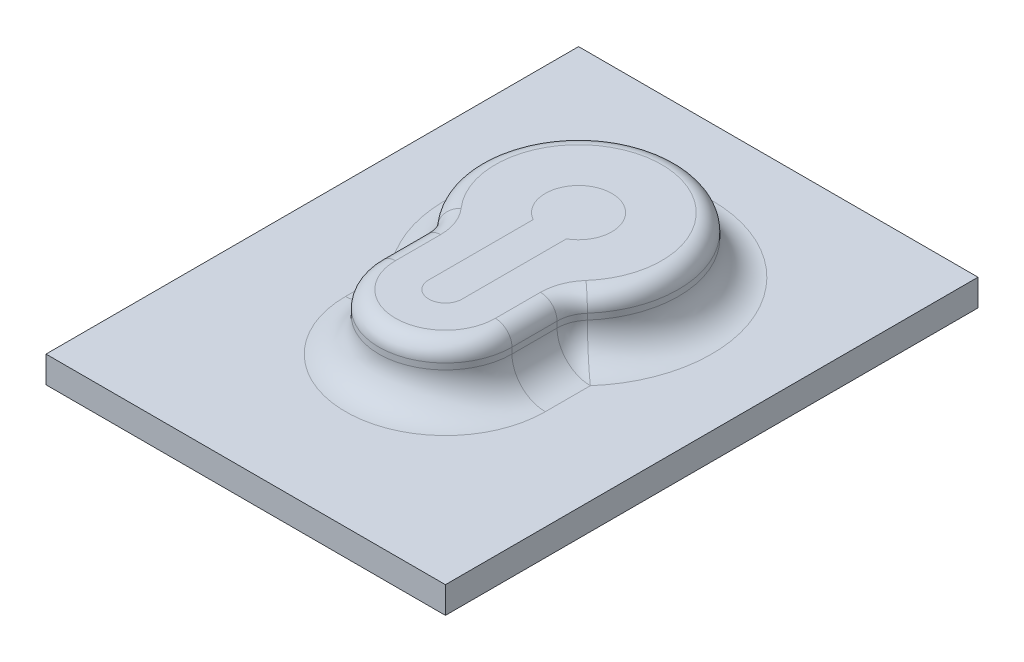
ISO-10303-21;
HEADER;
FILE_DESCRIPTION(('STEP AP214'),'2;1');
FILE_NAME('part.step','',(''),(''),'','','');
FILE_SCHEMA(('AUTOMOTIVE_DESIGN { 1 0 10303 214 1 1 1 1 }'));
ENDSEC;
DATA;
#1=APPLICATION_CONTEXT('core data for automotive mechanical design processes');
#2=APPLICATION_PROTOCOL_DEFINITION('international standard','automotive_design',2000,#1);
#3=PRODUCT_CONTEXT('',#1,'mechanical');
#4=PRODUCT('Part','Part','',(#3));
#5=PRODUCT_RELATED_PRODUCT_CATEGORY('part','',(#4));
#6=PRODUCT_DEFINITION_FORMATION('','',#4);
#7=PRODUCT_DEFINITION_CONTEXT('part definition',#1,'design');
#8=PRODUCT_DEFINITION('design','',#6,#7);
#9=PRODUCT_DEFINITION_SHAPE('','',#8);
#10=(LENGTH_UNIT() NAMED_UNIT(*) SI_UNIT(.MILLI.,.METRE.));
#11=(NAMED_UNIT(*) PLANE_ANGLE_UNIT() SI_UNIT($,.RADIAN.));
#12=(NAMED_UNIT(*) SI_UNIT($,.STERADIAN.) SOLID_ANGLE_UNIT());
#13=UNCERTAINTY_MEASURE_WITH_UNIT(LENGTH_MEASURE(1.E-05),#10,'distance_accuracy_value','');
#14=(GEOMETRIC_REPRESENTATION_CONTEXT(3) GLOBAL_UNCERTAINTY_ASSIGNED_CONTEXT((#13)) GLOBAL_UNIT_ASSIGNED_CONTEXT((#10,
#11,#12)) REPRESENTATION_CONTEXT('',''));
#15=CARTESIAN_POINT('',(0.,0.,0.));
#16=DIRECTION('',(0.,0.,1.));
#17=DIRECTION('',(1.,0.,0.));
#18=AXIS2_PLACEMENT_3D('',#15,#16,#17);
#19=CARTESIAN_POINT('',(9.525,7.874,8.40026041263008));
#20=DIRECTION('',(0.,-1.,0.));
#21=DIRECTION('',(0.,0.,-1.));
#22=AXIS2_PLACEMENT_3D('',#19,#20,#21);
#23=PLANE('',#22);
#24=CARTESIAN_POINT('',(-9.525,7.874,8.40026041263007));
#25=DIRECTION('',(0.,-1.,0.));
#26=DIRECTION('',(0.,0.,-1.));
#27=AXIS2_PLACEMENT_3D('',#24,#25,#26);
#28=CIRCLE('',#27,4.7625);
#29=CARTESIAN_POINT('',(-5.953125,7.874,5.25016275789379));
#30=VERTEX_POINT('',#29);
#31=CARTESIAN_POINT('',(-4.7625,7.874,8.40026041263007));
#32=VERTEX_POINT('',#31);
#33=EDGE_CURVE('E236',#30,#32,#28,.T.);
#34=ORIENTED_EDGE('',*,*,#33,.T.);
#35=DIRECTION('',(0.,0.,1.));
#36=VECTOR('',#35,1.);
#37=CARTESIAN_POINT('',(-4.7625,7.874,8.40026041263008));
#38=LINE('',#37,#36);
#39=CARTESIAN_POINT('',(-4.7625,7.874,12.7));
#40=VERTEX_POINT('',#39);
#41=EDGE_CURVE('E238',#32,#40,#38,.T.);
#42=ORIENTED_EDGE('',*,*,#41,.T.);
#43=CARTESIAN_POINT('',(0.,7.874,12.7));
#44=DIRECTION('',(0.,-1.,0.));
#45=DIRECTION('',(0.,0.,-1.));
#46=AXIS2_PLACEMENT_3D('',#43,#44,#45);
#47=CIRCLE('',#46,4.7625);
#48=CARTESIAN_POINT('',(4.7625,7.874,12.7));
#49=VERTEX_POINT('',#48);
#50=EDGE_CURVE('E209',#40,#49,#47,.F.);
#51=ORIENTED_EDGE('',*,*,#50,.T.);
#52=DIRECTION('',(0.,0.,-1.));
#53=VECTOR('',#52,1.);
#54=CARTESIAN_POINT('',(4.7625,7.874,8.40026041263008));
#55=LINE('',#54,#53);
#56=CARTESIAN_POINT('',(4.7625,7.874,8.40026041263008));
#57=VERTEX_POINT('',#56);
#58=EDGE_CURVE('E230',#49,#57,#55,.T.);
#59=ORIENTED_EDGE('',*,*,#58,.T.);
#60=CARTESIAN_POINT('',(9.525,7.874,8.40026041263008));
#61=DIRECTION('',(0.,-1.,0.));
#62=DIRECTION('',(0.,0.,-1.));
#63=AXIS2_PLACEMENT_3D('',#60,#61,#62);
#64=CIRCLE('',#63,4.7625);
#65=CARTESIAN_POINT('',(5.953125,7.874,5.2501627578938));
#66=VERTEX_POINT('',#65);
#67=EDGE_CURVE('E232',#57,#66,#64,.T.);
#68=ORIENTED_EDGE('',*,*,#67,.T.);
#69=CARTESIAN_POINT('',(0.,7.874,0.));
#70=DIRECTION('',(0.,-1.,0.));
#71=DIRECTION('',(0.,0.,-1.));
#72=AXIS2_PLACEMENT_3D('',#69,#70,#71);
#73=CIRCLE('',#72,7.9375);
#74=EDGE_CURVE('E234',#66,#30,#73,.F.);
#75=ORIENTED_EDGE('',*,*,#74,.T.);
#76=EDGE_LOOP('',(#34,#42,#51,#59,#68,#75));
#77=FACE_BOUND('',#76,.T.);
#78=CARTESIAN_POINT('',(0.,7.874,12.7));
#79=DIRECTION('',(0.,-1.,0.));
#80=DIRECTION('',(0.,0.,-1.));
#81=AXIS2_PLACEMENT_3D('',#78,#79,#80);
#82=CIRCLE('',#81,1.5875);
#83=CARTESIAN_POINT('',(-1.5875,7.874,12.7));
#84=VERTEX_POINT('',#83);
#85=CARTESIAN_POINT('',(1.5875,7.874,12.7));
#86=VERTEX_POINT('',#85);
#87=EDGE_CURVE('E12',#84,#86,#82,.F.);
#88=ORIENTED_EDGE('',*,*,#87,.F.);
#89=DIRECTION('',(0.,0.,1.));
#90=VECTOR('',#89,1.);
#91=CARTESIAN_POINT('',(-1.5875,7.874,8.40026041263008));
#92=LINE('',#91,#90);
#93=CARTESIAN_POINT('',(-1.5875,7.874,2.74963065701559));
#94=VERTEX_POINT('',#93);
#95=EDGE_CURVE('E254',#94,#84,#92,.T.);
#96=ORIENTED_EDGE('',*,*,#95,.F.);
#97=CARTESIAN_POINT('',(0.,7.874,0.));
#98=DIRECTION('',(0.,-1.,0.));
#99=DIRECTION('',(0.,0.,-1.));
#100=AXIS2_PLACEMENT_3D('',#97,#98,#99);
#101=CIRCLE('',#100,3.175);
#102=CARTESIAN_POINT('',(1.5875,7.874,2.74963065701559));
#103=VERTEX_POINT('',#102);
#104=EDGE_CURVE('E272',#103,#94,#101,.F.);
#105=ORIENTED_EDGE('',*,*,#104,.F.);
#106=DIRECTION('',(0.,0.,-1.));
#107=VECTOR('',#106,1.);
#108=CARTESIAN_POINT('',(1.5875,7.874,8.40026041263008));
#109=LINE('',#108,#107);
#110=EDGE_CURVE('E46',#86,#103,#109,.T.);
#111=ORIENTED_EDGE('',*,*,#110,.F.);
#112=EDGE_LOOP('',(#88,#96,#105,#111));
#113=FACE_BOUND('',#112,.T.);
#114=ADVANCED_FACE('F37',(#77,#113),#23,.F.);
#115=CARTESIAN_POINT('',(-19.05,2.54,-19.05));
#116=DIRECTION('',(1.,0.,0.));
#117=DIRECTION('',(0.,0.,-1.));
#118=AXIS2_PLACEMENT_3D('',#115,#116,#117);
#119=PLANE('',#118);
#120=DIRECTION('',(0.,0.,1.));
#121=VECTOR('',#120,1.);
#122=CARTESIAN_POINT('',(-19.05,0.,-19.05));
#123=LINE('',#122,#121);
#124=CARTESIAN_POINT('',(-19.05,0.,-19.05));
#125=VERTEX_POINT('',#124);
#126=CARTESIAN_POINT('',(-19.05,0.,31.75));
#127=VERTEX_POINT('',#126);
#128=EDGE_CURVE('E176',#125,#127,#123,.T.);
#129=ORIENTED_EDGE('',*,*,#128,.T.);
#130=DIRECTION('',(0.,-1.,0.));
#131=VECTOR('',#130,1.);
#132=CARTESIAN_POINT('',(-19.05,2.54,31.75));
#133=LINE('',#132,#131);
#134=CARTESIAN_POINT('',(-19.05,2.54,31.75));
#135=VERTEX_POINT('',#134);
#136=EDGE_CURVE('E156',#135,#127,#133,.T.);
#137=ORIENTED_EDGE('',*,*,#136,.F.);
#138=DIRECTION('',(0.,0.,1.));
#139=VECTOR('',#138,1.);
#140=CARTESIAN_POINT('',(-19.05,2.54,-19.05));
#141=LINE('',#140,#139);
#142=CARTESIAN_POINT('',(-19.05,2.54,-19.05));
#143=VERTEX_POINT('',#142);
#144=EDGE_CURVE('E163',#143,#135,#141,.T.);
#145=ORIENTED_EDGE('',*,*,#144,.F.);
#146=DIRECTION('',(0.,-1.,0.));
#147=VECTOR('',#146,1.);
#148=CARTESIAN_POINT('',(-19.05,2.54,-19.05));
#149=LINE('',#148,#147);
#150=EDGE_CURVE('E413',#143,#125,#149,.T.);
#151=ORIENTED_EDGE('',*,*,#150,.T.);
#152=EDGE_LOOP('',(#129,#137,#145,#151));
#153=FACE_BOUND('',#152,.T.);
#154=ADVANCED_FACE('F174',(#153),#119,.F.);
#155=CARTESIAN_POINT('',(19.05,2.54,31.75));
#156=DIRECTION('',(0.,0.,-1.));
#157=DIRECTION('',(-1.,0.,0.));
#158=AXIS2_PLACEMENT_3D('',#155,#156,#157);
#159=PLANE('',#158);
#160=DIRECTION('',(1.,0.,0.));
#161=VECTOR('',#160,1.);
#162=CARTESIAN_POINT('',(19.05,0.,31.75));
#163=LINE('',#162,#161);
#164=CARTESIAN_POINT('',(19.05,0.,31.75));
#165=VERTEX_POINT('',#164);
#166=EDGE_CURVE('E415',#127,#165,#163,.T.);
#167=ORIENTED_EDGE('',*,*,#166,.T.);
#168=DIRECTION('',(0.,-1.,0.));
#169=VECTOR('',#168,1.);
#170=CARTESIAN_POINT('',(19.05,2.54,31.75));
#171=LINE('',#170,#169);
#172=CARTESIAN_POINT('',(19.05,2.54,31.75));
#173=VERTEX_POINT('',#172);
#174=EDGE_CURVE('E159',#173,#165,#171,.T.);
#175=ORIENTED_EDGE('',*,*,#174,.F.);
#176=DIRECTION('',(1.,0.,0.));
#177=VECTOR('',#176,1.);
#178=CARTESIAN_POINT('',(19.05,2.54,31.75));
#179=LINE('',#178,#177);
#180=EDGE_CURVE('E152',#135,#173,#179,.T.);
#181=ORIENTED_EDGE('',*,*,#180,.F.);
#182=ORIENTED_EDGE('',*,*,#136,.T.);
#183=EDGE_LOOP('',(#167,#175,#181,#182));
#184=FACE_BOUND('',#183,.T.);
#185=ADVANCED_FACE('F154',(#184),#159,.F.);
#186=CARTESIAN_POINT('',(19.05,2.54,-19.05));
#187=DIRECTION('',(-1.,0.,0.));
#188=DIRECTION('',(0.,0.,1.));
#189=AXIS2_PLACEMENT_3D('',#186,#187,#188);
#190=PLANE('',#189);
#191=DIRECTION('',(0.,0.,-1.));
#192=VECTOR('',#191,1.);
#193=CARTESIAN_POINT('',(19.05,0.,-19.05));
#194=LINE('',#193,#192);
#195=CARTESIAN_POINT('',(19.05,0.,-19.05));
#196=VERTEX_POINT('',#195);
#197=EDGE_CURVE('E417',#165,#196,#194,.T.);
#198=ORIENTED_EDGE('',*,*,#197,.T.);
#199=DIRECTION('',(0.,-1.,0.));
#200=VECTOR('',#199,1.);
#201=CARTESIAN_POINT('',(19.05,2.54,-19.05));
#202=LINE('',#201,#200);
#203=CARTESIAN_POINT('',(19.05,2.54,-19.05));
#204=VERTEX_POINT('',#203);
#205=EDGE_CURVE('E182',#204,#196,#202,.T.);
#206=ORIENTED_EDGE('',*,*,#205,.F.);
#207=DIRECTION('',(0.,0.,-1.));
#208=VECTOR('',#207,1.);
#209=CARTESIAN_POINT('',(19.05,2.54,-19.05));
#210=LINE('',#209,#208);
#211=EDGE_CURVE('E162',#173,#204,#210,.T.);
#212=ORIENTED_EDGE('',*,*,#211,.F.);
#213=ORIENTED_EDGE('',*,*,#174,.T.);
#214=EDGE_LOOP('',(#198,#206,#212,#213));
#215=FACE_BOUND('',#214,.T.);
#216=ADVANCED_FACE('F339',(#215),#190,.F.);
#217=CARTESIAN_POINT('',(19.05,2.54,-19.05));
#218=DIRECTION('',(0.,0.,1.));
#219=DIRECTION('',(1.,0.,0.));
#220=AXIS2_PLACEMENT_3D('',#217,#218,#219);
#221=PLANE('',#220);
#222=DIRECTION('',(-1.,0.,0.));
#223=VECTOR('',#222,1.);
#224=CARTESIAN_POINT('',(19.05,0.,-19.05));
#225=LINE('',#224,#223);
#226=EDGE_CURVE('E172',#196,#125,#225,.T.);
#227=ORIENTED_EDGE('',*,*,#226,.T.);
#228=ORIENTED_EDGE('',*,*,#150,.F.);
#229=DIRECTION('',(-1.,0.,0.));
#230=VECTOR('',#229,1.);
#231=CARTESIAN_POINT('',(19.05,2.54,-19.05));
#232=LINE('',#231,#230);
#233=EDGE_CURVE('E168',#204,#143,#232,.T.);
#234=ORIENTED_EDGE('',*,*,#233,.F.);
#235=ORIENTED_EDGE('',*,*,#205,.T.);
#236=EDGE_LOOP('',(#227,#228,#234,#235));
#237=FACE_BOUND('',#236,.T.);
#238=ADVANCED_FACE('F332',(#237),#221,.F.);
#239=CARTESIAN_POINT('',(0.,2.54,0.));
#240=DIRECTION('',(0.,-1.,0.));
#241=DIRECTION('',(0.,0.,-1.));
#242=AXIS2_PLACEMENT_3D('',#239,#240,#241);
#243=PLANE('',#242);
#244=CARTESIAN_POINT('',(0.,2.54,12.7));
#245=DIRECTION('',(0.,-1.,0.));
#246=DIRECTION('',(0.,0.,-1.));
#247=AXIS2_PLACEMENT_3D('',#244,#245,#246);
#248=CIRCLE('',#247,9.525);
#249=CARTESIAN_POINT('',(9.525,2.54,12.7));
#250=VERTEX_POINT('',#249);
#251=CARTESIAN_POINT('',(-9.525,2.54,12.7));
#252=VERTEX_POINT('',#251);
#253=EDGE_CURVE('E180',#250,#252,#248,.T.);
#254=ORIENTED_EDGE('',*,*,#253,.T.);
#255=DIRECTION('',(0.,0.,1.));
#256=VECTOR('',#255,1.);
#257=CARTESIAN_POINT('',(-9.525,2.54,8.40026041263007));
#258=LINE('',#257,#256);
#259=CARTESIAN_POINT('',(-9.525,2.54,8.40026041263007));
#260=VERTEX_POINT('',#259);
#261=EDGE_CURVE('E191',#252,#260,#258,.F.);
#262=ORIENTED_EDGE('',*,*,#261,.T.);
#263=CARTESIAN_POINT('',(0.,2.54,0.));
#264=DIRECTION('',(0.,-1.,0.));
#265=DIRECTION('',(0.,0.,-1.));
#266=AXIS2_PLACEMENT_3D('',#263,#264,#265);
#267=CIRCLE('',#266,12.7);
#268=CARTESIAN_POINT('',(9.525,2.54,8.40026041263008));
#269=VERTEX_POINT('',#268);
#270=EDGE_CURVE('E189',#260,#269,#267,.T.);
#271=ORIENTED_EDGE('',*,*,#270,.T.);
#272=DIRECTION('',(0.,0.,-1.));
#273=VECTOR('',#272,1.);
#274=CARTESIAN_POINT('',(9.525,2.54,12.7));
#275=LINE('',#274,#273);
#276=EDGE_CURVE('E187',#269,#250,#275,.F.);
#277=ORIENTED_EDGE('',*,*,#276,.T.);
#278=EDGE_LOOP('',(#254,#262,#271,#277));
#279=FACE_BOUND('',#278,.T.);
#280=ORIENTED_EDGE('',*,*,#144,.T.);
#281=ORIENTED_EDGE('',*,*,#180,.T.);
#282=ORIENTED_EDGE('',*,*,#211,.T.);
#283=ORIENTED_EDGE('',*,*,#233,.T.);
#284=EDGE_LOOP('',(#280,#281,#282,#283));
#285=FACE_BOUND('',#284,.T.);
#286=ADVANCED_FACE('F166',(#279,#285),#243,.F.);
#287=CARTESIAN_POINT('',(0.,0.,0.));
#288=DIRECTION('',(0.,-1.,0.));
#289=DIRECTION('',(0.,0.,-1.));
#290=AXIS2_PLACEMENT_3D('',#287,#288,#289);
#291=PLANE('',#290);
#292=ORIENTED_EDGE('',*,*,#128,.F.);
#293=ORIENTED_EDGE('',*,*,#226,.F.);
#294=ORIENTED_EDGE('',*,*,#197,.F.);
#295=ORIENTED_EDGE('',*,*,#166,.F.);
#296=EDGE_LOOP('',(#292,#293,#294,#295));
#297=FACE_BOUND('',#296,.T.);
#298=ADVANCED_FACE('F328',(#297),#291,.T.);
#299=CARTESIAN_POINT('',(9.525,7.874,8.40026041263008));
#300=DIRECTION('',(0.,-1.,0.));
#301=DIRECTION('',(0.,0.,-1.));
#302=AXIS2_PLACEMENT_3D('',#299,#300,#301);
#303=CYLINDRICAL_SURFACE('',#302,3.175);
#304=DIRECTION('',(0.,-1.,0.));
#305=VECTOR('',#304,1.);
#306=CARTESIAN_POINT('',(7.14375,7.874,6.30019530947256));
#307=LINE('',#306,#305);
#308=CARTESIAN_POINT('',(7.14375,6.2865,6.30019530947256));
#309=VERTEX_POINT('',#308);
#310=CARTESIAN_POINT('',(7.14375,5.715,6.30019530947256));
#311=VERTEX_POINT('',#310);
#312=EDGE_CURVE('E396',#309,#311,#307,.T.);
#313=ORIENTED_EDGE('',*,*,#312,.F.);
#314=CARTESIAN_POINT('',(9.525,6.2865,8.40026041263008));
#315=DIRECTION('',(0.,-1.,0.));
#316=DIRECTION('',(0.,0.,-1.));
#317=AXIS2_PLACEMENT_3D('',#314,#315,#316);
#318=CIRCLE('',#317,3.175);
#319=CARTESIAN_POINT('',(6.35,6.2865,8.40026041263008));
#320=VERTEX_POINT('',#319);
#321=EDGE_CURVE('E248',#309,#320,#318,.F.);
#322=ORIENTED_EDGE('',*,*,#321,.T.);
#323=DIRECTION('',(0.,-1.,0.));
#324=VECTOR('',#323,1.);
#325=CARTESIAN_POINT('',(6.35,7.874,8.40026041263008));
#326=LINE('',#325,#324);
#327=CARTESIAN_POINT('',(6.35,5.715,8.40026041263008));
#328=VERTEX_POINT('',#327);
#329=EDGE_CURVE('E228',#320,#328,#326,.T.);
#330=ORIENTED_EDGE('',*,*,#329,.T.);
#331=CARTESIAN_POINT('',(9.525,5.715,8.40026041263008));
#332=DIRECTION('',(0.,-1.,0.));
#333=DIRECTION('',(0.,0.,-1.));
#334=AXIS2_PLACEMENT_3D('',#331,#332,#333);
#335=CIRCLE('',#334,3.175);
#336=EDGE_CURVE('E200',#328,#311,#335,.T.);
#337=ORIENTED_EDGE('',*,*,#336,.T.);
#338=EDGE_LOOP('',(#313,#322,#330,#337));
#339=FACE_BOUND('',#338,.T.);
#340=ADVANCED_FACE('F324',(#339),#303,.F.);
#341=CARTESIAN_POINT('',(0.,7.874,0.));
#342=DIRECTION('',(0.,-1.,0.));
#343=DIRECTION('',(0.,0.,-1.));
#344=AXIS2_PLACEMENT_3D('',#341,#342,#343);
#345=CYLINDRICAL_SURFACE('',#344,9.525);
#346=DIRECTION('',(0.,-1.,0.));
#347=VECTOR('',#346,1.);
#348=CARTESIAN_POINT('',(-7.14375,7.874,6.30019530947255));
#349=LINE('',#348,#347);
#350=CARTESIAN_POINT('',(-7.14375,6.2865,6.30019530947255));
#351=VERTEX_POINT('',#350);
#352=CARTESIAN_POINT('',(-7.14375,5.715,6.30019530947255));
#353=VERTEX_POINT('',#352);
#354=EDGE_CURVE('E408',#351,#353,#349,.T.);
#355=ORIENTED_EDGE('',*,*,#354,.F.);
#356=CARTESIAN_POINT('',(0.,6.2865,0.));
#357=DIRECTION('',(0.,-1.,0.));
#358=DIRECTION('',(0.,0.,-1.));
#359=AXIS2_PLACEMENT_3D('',#356,#357,#358);
#360=CIRCLE('',#359,9.525);
#361=EDGE_CURVE('E246',#351,#309,#360,.T.);
#362=ORIENTED_EDGE('',*,*,#361,.T.);
#363=ORIENTED_EDGE('',*,*,#312,.T.);
#364=CARTESIAN_POINT('',(0.,5.715,0.));
#365=DIRECTION('',(0.,-1.,0.));
#366=DIRECTION('',(0.,0.,-1.));
#367=AXIS2_PLACEMENT_3D('',#364,#365,#366);
#368=CIRCLE('',#367,9.525);
#369=EDGE_CURVE('E197',#311,#353,#368,.F.);
#370=ORIENTED_EDGE('',*,*,#369,.T.);
#371=EDGE_LOOP('',(#355,#362,#363,#370));
#372=FACE_BOUND('',#371,.T.);
#373=ADVANCED_FACE('F320',(#372),#345,.T.);
#374=CARTESIAN_POINT('',(-9.525,7.874,8.40026041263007));
#375=DIRECTION('',(0.,-1.,0.));
#376=DIRECTION('',(0.,0.,-1.));
#377=AXIS2_PLACEMENT_3D('',#374,#375,#376);
#378=CYLINDRICAL_SURFACE('',#377,3.175);
#379=DIRECTION('',(0.,-1.,0.));
#380=VECTOR('',#379,1.);
#381=CARTESIAN_POINT('',(-6.35,7.874,8.40026041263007));
#382=LINE('',#381,#380);
#383=CARTESIAN_POINT('',(-6.35,6.2865,8.40026041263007));
#384=VERTEX_POINT('',#383);
#385=CARTESIAN_POINT('',(-6.35,5.715,8.40026041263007));
#386=VERTEX_POINT('',#385);
#387=EDGE_CURVE('E406',#384,#386,#382,.T.);
#388=ORIENTED_EDGE('',*,*,#387,.F.);
#389=CARTESIAN_POINT('',(-9.525,6.2865,8.40026041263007));
#390=DIRECTION('',(0.,-1.,0.));
#391=DIRECTION('',(0.,0.,-1.));
#392=AXIS2_PLACEMENT_3D('',#389,#390,#391);
#393=CIRCLE('',#392,3.175);
#394=EDGE_CURVE('E244',#384,#351,#393,.F.);
#395=ORIENTED_EDGE('',*,*,#394,.T.);
#396=ORIENTED_EDGE('',*,*,#354,.T.);
#397=CARTESIAN_POINT('',(-9.525,5.715,8.40026041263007));
#398=DIRECTION('',(0.,-1.,0.));
#399=DIRECTION('',(0.,0.,-1.));
#400=AXIS2_PLACEMENT_3D('',#397,#398,#399);
#401=CIRCLE('',#400,3.175);
#402=EDGE_CURVE('E194',#353,#386,#401,.T.);
#403=ORIENTED_EDGE('',*,*,#402,.T.);
#404=EDGE_LOOP('',(#388,#395,#396,#403));
#405=FACE_BOUND('',#404,.T.);
#406=ADVANCED_FACE('F316',(#405),#378,.F.);
#407=CARTESIAN_POINT('',(-6.35,7.874,8.40026041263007));
#408=DIRECTION('',(1.,0.,0.));
#409=DIRECTION('',(0.,0.,-1.));
#410=AXIS2_PLACEMENT_3D('',#407,#408,#409);
#411=PLANE('',#410);
#412=DIRECTION('',(0.,-1.,0.));
#413=VECTOR('',#412,1.);
#414=CARTESIAN_POINT('',(-6.35,7.874,12.7));
#415=LINE('',#414,#413);
#416=CARTESIAN_POINT('',(-6.35,6.2865,12.7));
#417=VERTEX_POINT('',#416);
#418=CARTESIAN_POINT('',(-6.35,5.715,12.7));
#419=VERTEX_POINT('',#418);
#420=EDGE_CURVE('E402',#417,#419,#415,.T.);
#421=ORIENTED_EDGE('',*,*,#420,.F.);
#422=DIRECTION('',(0.,0.,1.));
#423=VECTOR('',#422,1.);
#424=CARTESIAN_POINT('',(-6.35,6.2865,8.40026041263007));
#425=LINE('',#424,#423);
#426=EDGE_CURVE('E241',#417,#384,#425,.F.);
#427=ORIENTED_EDGE('',*,*,#426,.T.);
#428=ORIENTED_EDGE('',*,*,#387,.T.);
#429=DIRECTION('',(0.,0.,1.));
#430=VECTOR('',#429,1.);
#431=CARTESIAN_POINT('',(-6.35,5.715,12.7));
#432=LINE('',#431,#430);
#433=EDGE_CURVE('E177',#386,#419,#432,.T.);
#434=ORIENTED_EDGE('',*,*,#433,.T.);
#435=EDGE_LOOP('',(#421,#427,#428,#434));
#436=FACE_BOUND('',#435,.T.);
#437=ADVANCED_FACE('F309',(#436),#411,.F.);
#438=CARTESIAN_POINT('',(0.,7.874,12.7));
#439=DIRECTION('',(0.,-1.,0.));
#440=DIRECTION('',(0.,0.,-1.));
#441=AXIS2_PLACEMENT_3D('',#438,#439,#440);
#442=CYLINDRICAL_SURFACE('',#441,6.35);
#443=DIRECTION('',(0.,-1.,0.));
#444=VECTOR('',#443,1.);
#445=CARTESIAN_POINT('',(6.35,7.874,12.7));
#446=LINE('',#445,#444);
#447=CARTESIAN_POINT('',(6.35,6.2865,12.7));
#448=VERTEX_POINT('',#447);
#449=CARTESIAN_POINT('',(6.35,5.715,12.7));
#450=VERTEX_POINT('',#449);
#451=EDGE_CURVE('E400',#448,#450,#446,.T.);
#452=ORIENTED_EDGE('',*,*,#451,.F.);
#453=CARTESIAN_POINT('',(0.,6.2865,12.7));
#454=DIRECTION('',(0.,-1.,0.));
#455=DIRECTION('',(0.,0.,-1.));
#456=AXIS2_PLACEMENT_3D('',#453,#454,#455);
#457=CIRCLE('',#456,6.35);
#458=EDGE_CURVE('E252',#448,#417,#457,.T.);
#459=ORIENTED_EDGE('',*,*,#458,.T.);
#460=ORIENTED_EDGE('',*,*,#420,.T.);
#461=CARTESIAN_POINT('',(0.,5.715,12.7));
#462=DIRECTION('',(0.,-1.,0.));
#463=DIRECTION('',(0.,0.,-1.));
#464=AXIS2_PLACEMENT_3D('',#461,#462,#463);
#465=CIRCLE('',#464,6.35);
#466=EDGE_CURVE('E206',#419,#450,#465,.F.);
#467=ORIENTED_EDGE('',*,*,#466,.T.);
#468=EDGE_LOOP('',(#452,#459,#460,#467));
#469=FACE_BOUND('',#468,.T.);
#470=ADVANCED_FACE('F304',(#469),#442,.T.);
#471=CARTESIAN_POINT('',(6.35,7.874,8.40026041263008));
#472=DIRECTION('',(-1.,0.,0.));
#473=DIRECTION('',(0.,0.,1.));
#474=AXIS2_PLACEMENT_3D('',#471,#472,#473);
#475=PLANE('',#474);
#476=ORIENTED_EDGE('',*,*,#329,.F.);
#477=DIRECTION('',(0.,0.,-1.));
#478=VECTOR('',#477,1.);
#479=CARTESIAN_POINT('',(6.35,6.2865,8.40026041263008));
#480=LINE('',#479,#478);
#481=EDGE_CURVE('E250',#320,#448,#480,.F.);
#482=ORIENTED_EDGE('',*,*,#481,.T.);
#483=ORIENTED_EDGE('',*,*,#451,.T.);
#484=DIRECTION('',(0.,0.,-1.));
#485=VECTOR('',#484,1.);
#486=CARTESIAN_POINT('',(6.35,5.715,8.40026041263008));
#487=LINE('',#486,#485);
#488=EDGE_CURVE('E203',#450,#328,#487,.T.);
#489=ORIENTED_EDGE('',*,*,#488,.T.);
#490=EDGE_LOOP('',(#476,#482,#483,#489));
#491=FACE_BOUND('',#490,.T.);
#492=ADVANCED_FACE('F296',(#491),#475,.F.);
#493=ORIENTED_EDGE('',*,*,#95,.T.);
#494=ORIENTED_EDGE('',*,*,#87,.T.);
#495=ORIENTED_EDGE('',*,*,#110,.T.);
#496=ORIENTED_EDGE('',*,*,#104,.T.);
#497=EDGE_LOOP('',(#493,#494,#495,#496));
#498=FACE_BOUND('',#497,.T.);
#499=ADVANCED_FACE('F284',(#498),#23,.F.);
#500=CARTESIAN_POINT('',(9.525,5.715,8.40026041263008));
#501=DIRECTION('',(0.,-1.,0.));
#502=DIRECTION('',(0.,0.,-1.));
#503=AXIS2_PLACEMENT_3D('',#500,#501,#502);
#504=SPHERICAL_SURFACE('',#503,3.175);
#505=CARTESIAN_POINT('',(9.525,5.715,8.40026041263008));
#506=DIRECTION('',(0.,0.,-1.));
#507=DIRECTION('',(-1.,0.,0.));
#508=AXIS2_PLACEMENT_3D('',#505,#506,#507);
#509=CIRCLE('',#508,3.175);
#510=EDGE_CURVE('E222',#269,#328,#509,.T.);
#511=ORIENTED_EDGE('',*,*,#510,.F.);
#512=CARTESIAN_POINT('',(9.525,5.715,8.40026041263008));
#513=DIRECTION('',(-0.661437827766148,0.,0.75));
#514=DIRECTION('',(0.75,0.,0.661437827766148));
#515=AXIS2_PLACEMENT_3D('',#512,#513,#514);
#516=CIRCLE('',#515,3.175);
#517=EDGE_CURVE('E225',#311,#269,#516,.T.);
#518=ORIENTED_EDGE('',*,*,#517,.F.);
#519=ORIENTED_EDGE('',*,*,#336,.F.);
#520=EDGE_LOOP('',(#511,#518,#519));
#521=FACE_BOUND('',#520,.T.);
#522=ADVANCED_FACE('F295',(#521),#504,.F.);
#523=CARTESIAN_POINT('',(0.,5.715,0.));
#524=DIRECTION('',(0.,-1.,0.));
#525=DIRECTION('',(0.,0.,-1.));
#526=AXIS2_PLACEMENT_3D('',#523,#524,#525);
#527=TOROIDAL_SURFACE('',#526,12.7,3.175);
#528=ORIENTED_EDGE('',*,*,#517,.T.);
#529=ORIENTED_EDGE('',*,*,#270,.F.);
#530=CARTESIAN_POINT('',(-9.525,5.715,8.40026041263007));
#531=DIRECTION('',(-0.661437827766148,0.,-0.75));
#532=DIRECTION('',(-0.75,0.,0.661437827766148));
#533=AXIS2_PLACEMENT_3D('',#530,#531,#532);
#534=CIRCLE('',#533,3.175);
#535=EDGE_CURVE('E219',#353,#260,#534,.T.);
#536=ORIENTED_EDGE('',*,*,#535,.F.);
#537=ORIENTED_EDGE('',*,*,#369,.F.);
#538=EDGE_LOOP('',(#528,#529,#536,#537));
#539=FACE_BOUND('',#538,.T.);
#540=ADVANCED_FACE('F301',(#539),#527,.F.);
#541=CARTESIAN_POINT('',(9.525,5.715,8.40026041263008));
#542=DIRECTION('',(0.,0.,1.));
#543=DIRECTION('',(1.,0.,0.));
#544=AXIS2_PLACEMENT_3D('',#541,#542,#543);
#545=CYLINDRICAL_SURFACE('',#544,3.175);
#546=ORIENTED_EDGE('',*,*,#510,.T.);
#547=ORIENTED_EDGE('',*,*,#488,.F.);
#548=CARTESIAN_POINT('',(9.525,5.715,12.7));
#549=DIRECTION('',(0.,0.,-1.));
#550=DIRECTION('',(-1.,0.,0.));
#551=AXIS2_PLACEMENT_3D('',#548,#549,#550);
#552=CIRCLE('',#551,3.175);
#553=EDGE_CURVE('E216',#250,#450,#552,.T.);
#554=ORIENTED_EDGE('',*,*,#553,.F.);
#555=ORIENTED_EDGE('',*,*,#276,.F.);
#556=EDGE_LOOP('',(#546,#547,#554,#555));
#557=FACE_BOUND('',#556,.T.);
#558=ADVANCED_FACE('F357',(#557),#545,.F.);
#559=CARTESIAN_POINT('',(-9.525,5.715,8.40026041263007));
#560=DIRECTION('',(0.,-1.,0.));
#561=DIRECTION('',(0.,0.,-1.));
#562=AXIS2_PLACEMENT_3D('',#559,#560,#561);
#563=SPHERICAL_SURFACE('',#562,3.175);
#564=ORIENTED_EDGE('',*,*,#402,.F.);
#565=ORIENTED_EDGE('',*,*,#535,.T.);
#566=CARTESIAN_POINT('',(-9.525,5.715,8.40026041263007));
#567=DIRECTION('',(0.,0.,-1.));
#568=DIRECTION('',(-1.,0.,0.));
#569=AXIS2_PLACEMENT_3D('',#566,#567,#568);
#570=CIRCLE('',#569,3.175);
#571=EDGE_CURVE('E213',#386,#260,#570,.T.);
#572=ORIENTED_EDGE('',*,*,#571,.F.);
#573=EDGE_LOOP('',(#564,#565,#572));
#574=FACE_BOUND('',#573,.T.);
#575=ADVANCED_FACE('F353',(#574),#563,.F.);
#576=CARTESIAN_POINT('',(0.,5.715,12.7));
#577=DIRECTION('',(0.,-1.,0.));
#578=DIRECTION('',(0.,0.,-1.));
#579=AXIS2_PLACEMENT_3D('',#576,#577,#578);
#580=TOROIDAL_SURFACE('',#579,9.525,3.175);
#581=ORIENTED_EDGE('',*,*,#553,.T.);
#582=ORIENTED_EDGE('',*,*,#466,.F.);
#583=CARTESIAN_POINT('',(-9.525,5.715,12.7));
#584=DIRECTION('',(0.,0.,1.));
#585=DIRECTION('',(1.,0.,0.));
#586=AXIS2_PLACEMENT_3D('',#583,#584,#585);
#587=CIRCLE('',#586,3.175);
#588=EDGE_CURVE('E210',#252,#419,#587,.T.);
#589=ORIENTED_EDGE('',*,*,#588,.F.);
#590=ORIENTED_EDGE('',*,*,#253,.F.);
#591=EDGE_LOOP('',(#581,#582,#589,#590));
#592=FACE_BOUND('',#591,.T.);
#593=ADVANCED_FACE('F349',(#592),#580,.F.);
#594=CARTESIAN_POINT('',(-9.525,5.715,8.40026041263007));
#595=DIRECTION('',(0.,0.,-1.));
#596=DIRECTION('',(-1.,0.,0.));
#597=AXIS2_PLACEMENT_3D('',#594,#595,#596);
#598=CYLINDRICAL_SURFACE('',#597,3.175);
#599=ORIENTED_EDGE('',*,*,#571,.T.);
#600=ORIENTED_EDGE('',*,*,#261,.F.);
#601=ORIENTED_EDGE('',*,*,#588,.T.);
#602=ORIENTED_EDGE('',*,*,#433,.F.);
#603=EDGE_LOOP('',(#599,#600,#601,#602));
#604=FACE_BOUND('',#603,.T.);
#605=ADVANCED_FACE('F346',(#604),#598,.F.);
#606=CARTESIAN_POINT('',(9.525,6.2865,8.40026041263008));
#607=DIRECTION('',(0.,-1.,0.));
#608=DIRECTION('',(0.,0.,-1.));
#609=AXIS2_PLACEMENT_3D('',#606,#607,#608);
#610=TOROIDAL_SURFACE('',#609,4.7625,1.5875);
#611=CARTESIAN_POINT('',(4.7625,6.2865,8.40026041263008));
#612=DIRECTION('',(0.,0.,1.));
#613=DIRECTION('',(1.,0.,0.));
#614=AXIS2_PLACEMENT_3D('',#611,#612,#613);
#615=CIRCLE('',#614,1.5875);
#616=EDGE_CURVE('E265',#320,#57,#615,.T.);
#617=ORIENTED_EDGE('',*,*,#616,.F.);
#618=ORIENTED_EDGE('',*,*,#321,.F.);
#619=CARTESIAN_POINT('',(5.953125,6.2865,5.2501627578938));
#620=DIRECTION('',(0.661437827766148,0.,-0.75));
#621=DIRECTION('',(-0.75,0.,-0.661437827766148));
#622=AXIS2_PLACEMENT_3D('',#619,#620,#621);
#623=CIRCLE('',#622,1.5875);
#624=EDGE_CURVE('E214',#66,#309,#623,.T.);
#625=ORIENTED_EDGE('',*,*,#624,.F.);
#626=ORIENTED_EDGE('',*,*,#67,.F.);
#627=EDGE_LOOP('',(#617,#618,#625,#626));
#628=FACE_BOUND('',#627,.T.);
#629=ADVANCED_FACE('F39',(#628),#610,.T.);
#630=CARTESIAN_POINT('',(0.,6.2865,0.));
#631=DIRECTION('',(0.,-1.,0.));
#632=DIRECTION('',(0.,0.,-1.));
#633=AXIS2_PLACEMENT_3D('',#630,#631,#632);
#634=TOROIDAL_SURFACE('',#633,7.9375,1.5875);
#635=ORIENTED_EDGE('',*,*,#624,.T.);
#636=ORIENTED_EDGE('',*,*,#361,.F.);
#637=CARTESIAN_POINT('',(-5.953125,6.2865,5.25016275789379));
#638=DIRECTION('',(0.661437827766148,0.,0.75));
#639=DIRECTION('',(0.75,0.,-0.661437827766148));
#640=AXIS2_PLACEMENT_3D('',#637,#638,#639);
#641=CIRCLE('',#640,1.5875);
#642=EDGE_CURVE('E262',#30,#351,#641,.T.);
#643=ORIENTED_EDGE('',*,*,#642,.F.);
#644=ORIENTED_EDGE('',*,*,#74,.F.);
#645=EDGE_LOOP('',(#635,#636,#643,#644));
#646=FACE_BOUND('',#645,.T.);
#647=ADVANCED_FACE('F379',(#646),#634,.T.);
#648=CARTESIAN_POINT('',(4.7625,6.2865,8.40026041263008));
#649=DIRECTION('',(0.,0.,-1.));
#650=DIRECTION('',(-1.,0.,0.));
#651=AXIS2_PLACEMENT_3D('',#648,#649,#650);
#652=CYLINDRICAL_SURFACE('',#651,1.5875);
#653=ORIENTED_EDGE('',*,*,#616,.T.);
#654=ORIENTED_EDGE('',*,*,#58,.F.);
#655=CARTESIAN_POINT('',(4.7625,6.2865,12.7));
#656=DIRECTION('',(0.,0.,1.));
#657=DIRECTION('',(1.,0.,0.));
#658=AXIS2_PLACEMENT_3D('',#655,#656,#657);
#659=CIRCLE('',#658,1.5875);
#660=EDGE_CURVE('E259',#448,#49,#659,.T.);
#661=ORIENTED_EDGE('',*,*,#660,.F.);
#662=ORIENTED_EDGE('',*,*,#481,.F.);
#663=EDGE_LOOP('',(#653,#654,#661,#662));
#664=FACE_BOUND('',#663,.T.);
#665=ADVANCED_FACE('F376',(#664),#652,.T.);
#666=CARTESIAN_POINT('',(-9.525,6.2865,8.40026041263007));
#667=DIRECTION('',(0.,-1.,0.));
#668=DIRECTION('',(0.,0.,-1.));
#669=AXIS2_PLACEMENT_3D('',#666,#667,#668);
#670=TOROIDAL_SURFACE('',#669,4.7625,1.5875);
#671=ORIENTED_EDGE('',*,*,#642,.T.);
#672=ORIENTED_EDGE('',*,*,#394,.F.);
#673=CARTESIAN_POINT('',(-4.7625,6.2865,8.40026041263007));
#674=DIRECTION('',(0.,0.,1.));
#675=DIRECTION('',(1.,0.,0.));
#676=AXIS2_PLACEMENT_3D('',#673,#674,#675);
#677=CIRCLE('',#676,1.5875);
#678=EDGE_CURVE('E257',#32,#384,#677,.T.);
#679=ORIENTED_EDGE('',*,*,#678,.F.);
#680=ORIENTED_EDGE('',*,*,#33,.F.);
#681=EDGE_LOOP('',(#671,#672,#679,#680));
#682=FACE_BOUND('',#681,.T.);
#683=ADVANCED_FACE('F372',(#682),#670,.T.);
#684=CARTESIAN_POINT('',(0.,6.2865,12.7));
#685=DIRECTION('',(0.,-1.,0.));
#686=DIRECTION('',(0.,0.,-1.));
#687=AXIS2_PLACEMENT_3D('',#684,#685,#686);
#688=TOROIDAL_SURFACE('',#687,4.7625,1.5875);
#689=ORIENTED_EDGE('',*,*,#660,.T.);
#690=ORIENTED_EDGE('',*,*,#50,.F.);
#691=CARTESIAN_POINT('',(-4.7625,6.2865,12.7));
#692=DIRECTION('',(0.,0.,-1.));
#693=DIRECTION('',(-1.,0.,0.));
#694=AXIS2_PLACEMENT_3D('',#691,#692,#693);
#695=CIRCLE('',#694,1.5875);
#696=EDGE_CURVE('E255',#417,#40,#695,.T.);
#697=ORIENTED_EDGE('',*,*,#696,.F.);
#698=ORIENTED_EDGE('',*,*,#458,.F.);
#699=EDGE_LOOP('',(#689,#690,#697,#698));
#700=FACE_BOUND('',#699,.T.);
#701=ADVANCED_FACE('F368',(#700),#688,.T.);
#702=CARTESIAN_POINT('',(-4.7625,6.2865,8.40026041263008));
#703=DIRECTION('',(0.,0.,1.));
#704=DIRECTION('',(1.,0.,0.));
#705=AXIS2_PLACEMENT_3D('',#702,#703,#704);
#706=CYLINDRICAL_SURFACE('',#705,1.5875);
#707=ORIENTED_EDGE('',*,*,#678,.T.);
#708=ORIENTED_EDGE('',*,*,#426,.F.);
#709=ORIENTED_EDGE('',*,*,#696,.T.);
#710=ORIENTED_EDGE('',*,*,#41,.F.);
#711=EDGE_LOOP('',(#707,#708,#709,#710));
#712=FACE_BOUND('',#711,.T.);
#713=ADVANCED_FACE('F365',(#712),#706,.T.);
#714=CLOSED_SHELL('',(#114,#154,#185,#216,#238,#286,#298,#340,#373,#406,#437,#470,#492,#499,
#522,#540,#558,#575,#593,#605,#629,#647,#665,#683,#701,#713));
#715=MANIFOLD_SOLID_BREP('B2',#714);
#716=ADVANCED_BREP_SHAPE_REPRESENTATION('',(#18,#715),#14);
#717=SHAPE_DEFINITION_REPRESENTATION(#9,#716);
ENDSEC;
END-ISO-10303-21;
